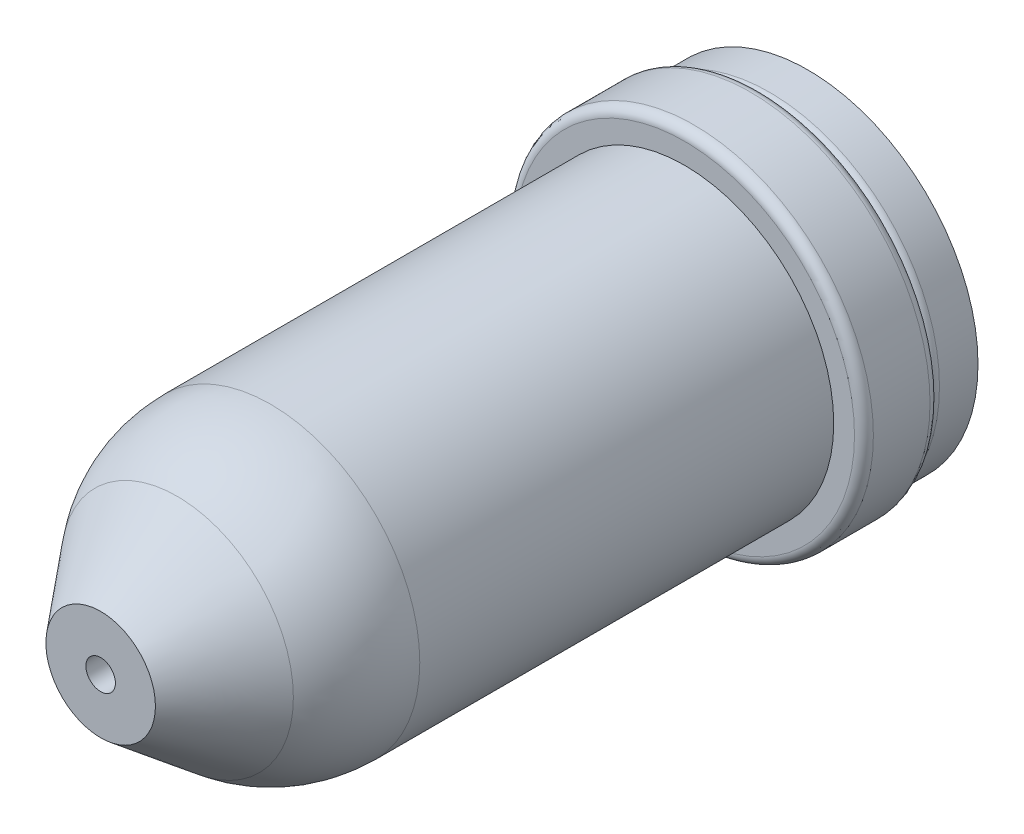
ISO-10303-21;
HEADER;
FILE_DESCRIPTION(('STEP AP214'),'2;1');
FILE_NAME('part.step','',(''),(''),'','','');
FILE_SCHEMA(('AUTOMOTIVE_DESIGN { 1 0 10303 214 1 1 1 1 }'));
ENDSEC;
DATA;
#1=APPLICATION_CONTEXT('core data for automotive mechanical design processes');
#2=APPLICATION_PROTOCOL_DEFINITION('international standard','automotive_design',2000,#1);
#3=PRODUCT_CONTEXT('',#1,'mechanical');
#4=PRODUCT('Part','Part','',(#3));
#5=PRODUCT_RELATED_PRODUCT_CATEGORY('part','',(#4));
#6=PRODUCT_DEFINITION_FORMATION('','',#4);
#7=PRODUCT_DEFINITION_CONTEXT('part definition',#1,'design');
#8=PRODUCT_DEFINITION('design','',#6,#7);
#9=PRODUCT_DEFINITION_SHAPE('','',#8);
#10=(LENGTH_UNIT() NAMED_UNIT(*) SI_UNIT(.MILLI.,.METRE.));
#11=(NAMED_UNIT(*) PLANE_ANGLE_UNIT() SI_UNIT($,.RADIAN.));
#12=(NAMED_UNIT(*) SI_UNIT($,.STERADIAN.) SOLID_ANGLE_UNIT());
#13=UNCERTAINTY_MEASURE_WITH_UNIT(LENGTH_MEASURE(1.E-05),#10,'distance_accuracy_value','');
#14=(GEOMETRIC_REPRESENTATION_CONTEXT(3) GLOBAL_UNCERTAINTY_ASSIGNED_CONTEXT((#13)) GLOBAL_UNIT_ASSIGNED_CONTEXT((#10,
#11,#12)) REPRESENTATION_CONTEXT('',''));
#15=CARTESIAN_POINT('',(0.,0.,0.));
#16=DIRECTION('',(0.,0.,1.));
#17=DIRECTION('',(1.,0.,0.));
#18=AXIS2_PLACEMENT_3D('',#15,#16,#17);
#19=CARTESIAN_POINT('',(21.7814439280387,-2.02947748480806,-237.871));
#20=DIRECTION('',(0.,0.,1.));
#21=DIRECTION('',(1.,0.,0.));
#22=AXIS2_PLACEMENT_3D('',#19,#20,#21);
#23=PLANE('',#22);
#24=CARTESIAN_POINT('',(-29.2648084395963,16.8960450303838,-237.871));
#25=DIRECTION('',(0.,0.,-1.));
#26=DIRECTION('',(-1.,0.,0.));
#27=AXIS2_PLACEMENT_3D('',#24,#25,#26);
#28=CIRCLE('',#27,2.5527);
#29=CARTESIAN_POINT('',(-31.8175084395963,16.8960450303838,-237.871));
#30=VERTEX_POINT('',#29);
#31=EDGE_CURVE('E121',#30,#30,#28,.T.);
#32=ORIENTED_EDGE('',*,*,#31,.F.);
#33=EDGE_LOOP('',(#32));
#34=FACE_BOUND('',#33,.T.);
#35=CARTESIAN_POINT('',(0.,-33.7920900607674,-237.871));
#36=DIRECTION('',(0.,0.,-1.));
#37=DIRECTION('',(-1.,0.,0.));
#38=AXIS2_PLACEMENT_3D('',#35,#36,#37);
#39=CIRCLE('',#38,2.5527);
#40=CARTESIAN_POINT('',(-2.55270000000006,-33.7920900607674,-237.871));
#41=VERTEX_POINT('',#40);
#42=EDGE_CURVE('E138',#41,#41,#39,.T.);
#43=ORIENTED_EDGE('',*,*,#42,.F.);
#44=EDGE_LOOP('',(#43));
#45=FACE_BOUND('',#44,.T.);
#46=CARTESIAN_POINT('',(29.2648084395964,16.8960450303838,-237.871));
#47=DIRECTION('',(0.,0.,-1.));
#48=DIRECTION('',(-1.,0.,0.));
#49=AXIS2_PLACEMENT_3D('',#46,#47,#48);
#50=CIRCLE('',#49,2.5527);
#51=CARTESIAN_POINT('',(26.7121084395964,16.8960450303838,-237.871));
#52=VERTEX_POINT('',#51);
#53=EDGE_CURVE('E122',#52,#52,#50,.T.);
#54=ORIENTED_EDGE('',*,*,#53,.F.);
#55=EDGE_LOOP('',(#54));
#56=FACE_BOUND('',#55,.T.);
#57=CARTESIAN_POINT('',(0.,0.,-237.871));
#58=DIRECTION('',(0.,0.,-1.));
#59=DIRECTION('',(-1.,0.,0.));
#60=AXIS2_PLACEMENT_3D('',#57,#58,#59);
#61=CIRCLE('',#60,57.15);
#62=CARTESIAN_POINT('',(-57.15,0.,-237.871));
#63=VERTEX_POINT('',#62);
#64=EDGE_CURVE('E131',#63,#63,#61,.T.);
#65=ORIENTED_EDGE('',*,*,#64,.T.);
#66=EDGE_LOOP('',(#65));
#67=FACE_BOUND('',#66,.T.);
#68=CARTESIAN_POINT('',(25.2966020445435,-14.605,-237.871));
#69=DIRECTION('',(0.,0.,1.));
#70=DIRECTION('',(1.,0.,0.));
#71=AXIS2_PLACEMENT_3D('',#68,#69,#70);
#72=CIRCLE('',#71,22.225);
#73=CARTESIAN_POINT('',(47.5216020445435,-14.605,-237.871));
#74=VERTEX_POINT('',#73);
#75=EDGE_CURVE('E194',#74,#74,#72,.F.);
#76=ORIENTED_EDGE('',*,*,#75,.F.);
#77=EDGE_LOOP('',(#76));
#78=FACE_BOUND('',#77,.T.);
#79=CARTESIAN_POINT('',(-25.2966020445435,-14.6049999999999,-237.871));
#80=DIRECTION('',(0.,0.,1.));
#81=DIRECTION('',(1.,0.,0.));
#82=AXIS2_PLACEMENT_3D('',#79,#80,#81);
#83=CIRCLE('',#82,22.225);
#84=CARTESIAN_POINT('',(-3.07160204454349,-14.6049999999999,-237.871));
#85=VERTEX_POINT('',#84);
#86=EDGE_CURVE('E198',#85,#85,#83,.F.);
#87=ORIENTED_EDGE('',*,*,#86,.F.);
#88=EDGE_LOOP('',(#87));
#89=FACE_BOUND('',#88,.T.);
#90=CARTESIAN_POINT('',(1.04083408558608E-13,29.2100000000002,-237.871));
#91=DIRECTION('',(0.,0.,1.));
#92=DIRECTION('',(1.,0.,0.));
#93=AXIS2_PLACEMENT_3D('',#90,#91,#92);
#94=CIRCLE('',#93,22.225);
#95=CARTESIAN_POINT('',(22.2250000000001,29.2100000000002,-237.871));
#96=VERTEX_POINT('',#95);
#97=EDGE_CURVE('E202',#96,#96,#94,.F.);
#98=ORIENTED_EDGE('',*,*,#97,.F.);
#99=EDGE_LOOP('',(#98));
#100=FACE_BOUND('',#99,.T.);
#101=ADVANCED_FACE('F84',(#34,#45,#56,#67,#78,#89,#100),#23,.F.);
#102=CARTESIAN_POINT('',(0.,0.,0.));
#103=DIRECTION('',(0.,0.,1.));
#104=DIRECTION('',(1.,0.,0.));
#105=AXIS2_PLACEMENT_3D('',#102,#103,#104);
#106=CYLINDRICAL_SURFACE('',#105,57.15);
#107=ORIENTED_EDGE('',*,*,#64,.F.);
#108=EDGE_LOOP('',(#107));
#109=FACE_BOUND('',#108,.T.);
#110=CARTESIAN_POINT('',(0.,0.,-224.917));
#111=DIRECTION('',(0.,0.,1.));
#112=DIRECTION('',(1.,0.,0.));
#113=AXIS2_PLACEMENT_3D('',#110,#111,#112);
#114=CIRCLE('',#113,57.15);
#115=CARTESIAN_POINT('',(57.15,0.,-224.917));
#116=VERTEX_POINT('',#115);
#117=EDGE_CURVE('E186',#116,#116,#114,.T.);
#118=ORIENTED_EDGE('',*,*,#117,.F.);
#119=EDGE_LOOP('',(#118));
#120=FACE_BOUND('',#119,.T.);
#121=ADVANCED_FACE('F236',(#109,#120),#106,.T.);
#122=CARTESIAN_POINT('',(0.,0.,-224.917));
#123=DIRECTION('',(0.,0.,1.));
#124=DIRECTION('',(1.,0.,0.));
#125=AXIS2_PLACEMENT_3D('',#122,#123,#124);
#126=TOROIDAL_SURFACE('',#125,53.975,3.175);
#127=ORIENTED_EDGE('',*,*,#117,.T.);
#128=EDGE_LOOP('',(#127));
#129=FACE_BOUND('',#128,.T.);
#130=CARTESIAN_POINT('',(0.,0.,-221.742));
#131=DIRECTION('',(0.,0.,1.));
#132=DIRECTION('',(1.,0.,0.));
#133=AXIS2_PLACEMENT_3D('',#130,#131,#132);
#134=CIRCLE('',#133,53.975);
#135=CARTESIAN_POINT('',(53.975,0.,-221.742));
#136=VERTEX_POINT('',#135);
#137=EDGE_CURVE('E182',#136,#136,#134,.T.);
#138=ORIENTED_EDGE('',*,*,#137,.F.);
#139=EDGE_LOOP('',(#138));
#140=FACE_BOUND('',#139,.T.);
#141=ADVANCED_FACE('F242',(#129,#140),#126,.T.);
#142=CARTESIAN_POINT('',(57.15,0.,-221.742));
#143=DIRECTION('',(0.,0.,-1.));
#144=DIRECTION('',(-1.,0.,0.));
#145=AXIS2_PLACEMENT_3D('',#142,#143,#144);
#146=PLANE('',#145);
#147=CARTESIAN_POINT('',(0.,0.,-221.742));
#148=DIRECTION('',(0.,0.,1.));
#149=DIRECTION('',(1.,0.,0.));
#150=AXIS2_PLACEMENT_3D('',#147,#148,#149);
#151=CIRCLE('',#150,57.15);
#152=CARTESIAN_POINT('',(57.15,0.,-221.742));
#153=VERTEX_POINT('',#152);
#154=EDGE_CURVE('E154',#153,#153,#151,.T.);
#155=ORIENTED_EDGE('',*,*,#154,.F.);
#156=EDGE_LOOP('',(#155));
#157=FACE_BOUND('',#156,.T.);
#158=ORIENTED_EDGE('',*,*,#137,.T.);
#159=EDGE_LOOP('',(#158));
#160=FACE_BOUND('',#159,.T.);
#161=ADVANCED_FACE('F251',(#157,#160),#146,.T.);
#162=CARTESIAN_POINT('',(50.165,0.,-196.342));
#163=DIRECTION('',(0.,0.,1.));
#164=DIRECTION('',(1.,0.,0.));
#165=AXIS2_PLACEMENT_3D('',#162,#163,#164);
#166=PLANE('',#165);
#167=CARTESIAN_POINT('',(0.,0.,-196.342));
#168=DIRECTION('',(0.,0.,1.));
#169=DIRECTION('',(1.,0.,0.));
#170=AXIS2_PLACEMENT_3D('',#167,#168,#169);
#171=CIRCLE('',#170,57.15);
#172=CARTESIAN_POINT('',(57.15,0.,-196.342));
#173=VERTEX_POINT('',#172);
#174=EDGE_CURVE('E166',#173,#173,#171,.T.);
#175=ORIENTED_EDGE('',*,*,#174,.T.);
#176=EDGE_LOOP('',(#175));
#177=FACE_BOUND('',#176,.T.);
#178=CARTESIAN_POINT('',(0.,0.,-196.342));
#179=DIRECTION('',(0.,0.,1.));
#180=DIRECTION('',(1.,0.,0.));
#181=AXIS2_PLACEMENT_3D('',#178,#179,#180);
#182=CIRCLE('',#181,50.165);
#183=CARTESIAN_POINT('',(50.165,0.,-196.342));
#184=VERTEX_POINT('',#183);
#185=EDGE_CURVE('E190',#184,#184,#182,.F.);
#186=ORIENTED_EDGE('',*,*,#185,.T.);
#187=EDGE_LOOP('',(#186));
#188=FACE_BOUND('',#187,.T.);
#189=ADVANCED_FACE('F254',(#177,#188),#166,.T.);
#190=CARTESIAN_POINT('',(0.,0.,-199.517));
#191=DIRECTION('',(0.,0.,1.));
#192=DIRECTION('',(1.,0.,0.));
#193=AXIS2_PLACEMENT_3D('',#190,#191,#192);
#194=TOROIDAL_SURFACE('',#193,57.15,3.175);
#195=CARTESIAN_POINT('',(0.,0.,-199.517));
#196=DIRECTION('',(0.,0.,1.));
#197=DIRECTION('',(1.,0.,0.));
#198=AXIS2_PLACEMENT_3D('',#195,#196,#197);
#199=CIRCLE('',#198,60.325);
#200=CARTESIAN_POINT('',(60.325,0.,-199.517));
#201=VERTEX_POINT('',#200);
#202=EDGE_CURVE('E162',#201,#201,#199,.T.);
#203=ORIENTED_EDGE('',*,*,#202,.T.);
#204=EDGE_LOOP('',(#203));
#205=FACE_BOUND('',#204,.T.);
#206=ORIENTED_EDGE('',*,*,#174,.F.);
#207=EDGE_LOOP('',(#206));
#208=FACE_BOUND('',#207,.T.);
#209=ADVANCED_FACE('F264',(#205,#208),#194,.T.);
#210=CARTESIAN_POINT('',(0.,0.,0.));
#211=DIRECTION('',(0.,0.,1.));
#212=DIRECTION('',(1.,0.,0.));
#213=AXIS2_PLACEMENT_3D('',#210,#211,#212);
#214=CYLINDRICAL_SURFACE('',#213,60.325);
#215=CARTESIAN_POINT('',(0.,0.,-218.567));
#216=DIRECTION('',(0.,0.,1.));
#217=DIRECTION('',(1.,0.,0.));
#218=AXIS2_PLACEMENT_3D('',#215,#216,#217);
#219=CIRCLE('',#218,60.325);
#220=CARTESIAN_POINT('',(60.325,0.,-218.567));
#221=VERTEX_POINT('',#220);
#222=EDGE_CURVE('E158',#221,#221,#219,.T.);
#223=ORIENTED_EDGE('',*,*,#222,.T.);
#224=EDGE_LOOP('',(#223));
#225=FACE_BOUND('',#224,.T.);
#226=ORIENTED_EDGE('',*,*,#202,.F.);
#227=EDGE_LOOP('',(#226));
#228=FACE_BOUND('',#227,.T.);
#229=ADVANCED_FACE('F260',(#225,#228),#214,.T.);
#230=CARTESIAN_POINT('',(0.,0.,-218.567));
#231=DIRECTION('',(0.,0.,1.));
#232=DIRECTION('',(1.,0.,0.));
#233=AXIS2_PLACEMENT_3D('',#230,#231,#232);
#234=TOROIDAL_SURFACE('',#233,57.15,3.175);
#235=ORIENTED_EDGE('',*,*,#154,.T.);
#236=EDGE_LOOP('',(#235));
#237=FACE_BOUND('',#236,.T.);
#238=ORIENTED_EDGE('',*,*,#222,.F.);
#239=EDGE_LOOP('',(#238));
#240=FACE_BOUND('',#239,.T.);
#241=ADVANCED_FACE('F256',(#237,#240),#234,.T.);
#242=CARTESIAN_POINT('',(18.415,0.,0.));
#243=DIRECTION('',(0.,0.,1.));
#244=DIRECTION('',(1.,0.,0.));
#245=AXIS2_PLACEMENT_3D('',#242,#243,#244);
#246=PLANE('',#245);
#247=CARTESIAN_POINT('',(0.,0.,0.));
#248=DIRECTION('',(0.,0.,1.));
#249=DIRECTION('',(1.,0.,0.));
#250=AXIS2_PLACEMENT_3D('',#247,#248,#249);
#251=CIRCLE('',#250,4.96062);
#252=CARTESIAN_POINT('',(4.96062,0.,0.));
#253=VERTEX_POINT('',#252);
#254=EDGE_CURVE('E146',#253,#253,#251,.T.);
#255=ORIENTED_EDGE('',*,*,#254,.F.);
#256=EDGE_LOOP('',(#255));
#257=FACE_BOUND('',#256,.T.);
#258=CARTESIAN_POINT('',(0.,0.,0.));
#259=DIRECTION('',(0.,0.,1.));
#260=DIRECTION('',(1.,0.,0.));
#261=AXIS2_PLACEMENT_3D('',#258,#259,#260);
#262=CIRCLE('',#261,18.415);
#263=CARTESIAN_POINT('',(18.415,0.,0.));
#264=VERTEX_POINT('',#263);
#265=EDGE_CURVE('E170',#264,#264,#262,.T.);
#266=ORIENTED_EDGE('',*,*,#265,.T.);
#267=EDGE_LOOP('',(#266));
#268=FACE_BOUND('',#267,.T.);
#269=ADVANCED_FACE('F259',(#257,#268),#246,.T.);
#270=CARTESIAN_POINT('',(0.,0.,0.));
#271=DIRECTION('',(0.,0.,-1.));
#272=DIRECTION('',(-1.,0.,0.));
#273=AXIS2_PLACEMENT_3D('',#270,#271,#272);
#274=CONICAL_SURFACE('',#273,18.415,0.67728119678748);
#275=CARTESIAN_POINT('',(0.,0.,-25.7127665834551));
#276=DIRECTION('',(0.,0.,1.));
#277=DIRECTION('',(1.,0.,0.));
#278=AXIS2_PLACEMENT_3D('',#275,#276,#277);
#279=CIRCLE('',#278,39.0925514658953);
#280=CARTESIAN_POINT('',(39.0925514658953,0.,-25.7127665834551));
#281=VERTEX_POINT('',#280);
#282=EDGE_CURVE('E174',#281,#281,#279,.T.);
#283=ORIENTED_EDGE('',*,*,#282,.T.);
#284=EDGE_LOOP('',(#283));
#285=FACE_BOUND('',#284,.T.);
#286=ORIENTED_EDGE('',*,*,#265,.F.);
#287=EDGE_LOOP('',(#286));
#288=FACE_BOUND('',#287,.T.);
#289=ADVANCED_FACE('F272',(#285,#288),#274,.T.);
#290=CARTESIAN_POINT('',(0.,0.,-57.15));
#291=DIRECTION('',(0.,0.,1.));
#292=DIRECTION('',(1.,0.,0.));
#293=AXIS2_PLACEMENT_3D('',#290,#291,#292);
#294=SPHERICAL_SURFACE('',#293,50.165);
#295=CARTESIAN_POINT('',(0.,0.,-57.15));
#296=DIRECTION('',(0.,0.,1.));
#297=DIRECTION('',(1.,0.,0.));
#298=AXIS2_PLACEMENT_3D('',#295,#296,#297);
#299=CIRCLE('',#298,50.165);
#300=CARTESIAN_POINT('',(50.165,0.,-57.15));
#301=VERTEX_POINT('',#300);
#302=EDGE_CURVE('E178',#301,#301,#299,.T.);
#303=ORIENTED_EDGE('',*,*,#302,.T.);
#304=EDGE_LOOP('',(#303));
#305=FACE_BOUND('',#304,.T.);
#306=ORIENTED_EDGE('',*,*,#282,.F.);
#307=EDGE_LOOP('',(#306));
#308=FACE_BOUND('',#307,.T.);
#309=ADVANCED_FACE('F275',(#305,#308),#294,.T.);
#310=CARTESIAN_POINT('',(0.,0.,0.));
#311=DIRECTION('',(0.,0.,1.));
#312=DIRECTION('',(1.,0.,0.));
#313=AXIS2_PLACEMENT_3D('',#310,#311,#312);
#314=CYLINDRICAL_SURFACE('',#313,50.165);
#315=ORIENTED_EDGE('',*,*,#185,.F.);
#316=EDGE_LOOP('',(#315));
#317=FACE_BOUND('',#316,.T.);
#318=ORIENTED_EDGE('',*,*,#302,.F.);
#319=EDGE_LOOP('',(#318));
#320=FACE_BOUND('',#319,.T.);
#321=ADVANCED_FACE('F279',(#317,#320),#314,.T.);
#322=CARTESIAN_POINT('',(0.,0.,-28.575));
#323=DIRECTION('',(0.,0.,1.));
#324=DIRECTION('',(1.,0.,0.));
#325=AXIS2_PLACEMENT_3D('',#322,#323,#324);
#326=CONICAL_SURFACE('',#325,4.96061999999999,1.02974425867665);
#327=CARTESIAN_POINT('',(0.,0.,-31.5556412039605));
#328=VERTEX_POINT('',#327);
#329=VERTEX_LOOP('',#328);
#330=FACE_BOUND('',#329,.T.);
#331=CARTESIAN_POINT('',(0.,0.,-28.575));
#332=DIRECTION('',(0.,0.,1.));
#333=DIRECTION('',(1.,0.,0.));
#334=AXIS2_PLACEMENT_3D('',#331,#332,#333);
#335=CIRCLE('',#334,4.96061999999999);
#336=CARTESIAN_POINT('',(4.96061999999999,0.,-28.575));
#337=VERTEX_POINT('',#336);
#338=EDGE_CURVE('E150',#337,#337,#335,.T.);
#339=ORIENTED_EDGE('',*,*,#338,.T.);
#340=EDGE_LOOP('',(#339));
#341=FACE_BOUND('',#340,.T.);
#342=ADVANCED_FACE('F249',(#330,#341),#326,.F.);
#343=CARTESIAN_POINT('',(0.,0.,0.));
#344=DIRECTION('',(0.,0.,1.));
#345=DIRECTION('',(1.,0.,0.));
#346=AXIS2_PLACEMENT_3D('',#343,#344,#345);
#347=CYLINDRICAL_SURFACE('',#346,4.96062);
#348=ORIENTED_EDGE('',*,*,#338,.F.);
#349=EDGE_LOOP('',(#348));
#350=FACE_BOUND('',#349,.T.);
#351=ORIENTED_EDGE('',*,*,#254,.T.);
#352=EDGE_LOOP('',(#351));
#353=FACE_BOUND('',#352,.T.);
#354=ADVANCED_FACE('F114',(#350,#353),#347,.F.);
#355=CARTESIAN_POINT('',(29.2648084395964,16.8960450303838,-218.821));
#356=DIRECTION('',(0.,0.,-1.));
#357=DIRECTION('',(-1.,0.,0.));
#358=AXIS2_PLACEMENT_3D('',#355,#356,#357);
#359=CONICAL_SURFACE('',#358,2.5527,1.02974425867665);
#360=CARTESIAN_POINT('',(29.2648084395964,16.8960450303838,-217.287183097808));
#361=VERTEX_POINT('',#360);
#362=VERTEX_LOOP('',#361);
#363=FACE_BOUND('',#362,.T.);
#364=CARTESIAN_POINT('',(29.2648084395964,16.8960450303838,-218.821));
#365=DIRECTION('',(0.,0.,-1.));
#366=DIRECTION('',(-1.,0.,0.));
#367=AXIS2_PLACEMENT_3D('',#364,#365,#366);
#368=CIRCLE('',#367,2.5527);
#369=CARTESIAN_POINT('',(26.7121084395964,16.8960450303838,-218.821));
#370=VERTEX_POINT('',#369);
#371=EDGE_CURVE('E118',#370,#370,#368,.T.);
#372=ORIENTED_EDGE('',*,*,#371,.T.);
#373=EDGE_LOOP('',(#372));
#374=FACE_BOUND('',#373,.T.);
#375=ADVANCED_FACE('F110',(#363,#374),#359,.F.);
#376=CARTESIAN_POINT('',(0.,-33.7920900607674,-218.821));
#377=DIRECTION('',(0.,0.,-1.));
#378=DIRECTION('',(-1.,0.,0.));
#379=AXIS2_PLACEMENT_3D('',#376,#377,#378);
#380=CONICAL_SURFACE('',#379,2.5527,1.02974425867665);
#381=CARTESIAN_POINT('',(0.,-33.7920900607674,-217.287183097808));
#382=VERTEX_POINT('',#381);
#383=VERTEX_LOOP('',#382);
#384=FACE_BOUND('',#383,.T.);
#385=CARTESIAN_POINT('',(0.,-33.7920900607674,-218.821));
#386=DIRECTION('',(0.,0.,-1.));
#387=DIRECTION('',(-1.,0.,0.));
#388=AXIS2_PLACEMENT_3D('',#385,#386,#387);
#389=CIRCLE('',#388,2.5527);
#390=CARTESIAN_POINT('',(-2.55270000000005,-33.7920900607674,-218.821));
#391=VERTEX_POINT('',#390);
#392=EDGE_CURVE('E142',#391,#391,#389,.T.);
#393=ORIENTED_EDGE('',*,*,#392,.T.);
#394=EDGE_LOOP('',(#393));
#395=FACE_BOUND('',#394,.T.);
#396=ADVANCED_FACE('F113',(#384,#395),#380,.F.);
#397=CARTESIAN_POINT('',(-29.2648084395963,16.8960450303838,-218.821));
#398=DIRECTION('',(0.,0.,-1.));
#399=DIRECTION('',(-1.,0.,0.));
#400=AXIS2_PLACEMENT_3D('',#397,#398,#399);
#401=CONICAL_SURFACE('',#400,2.5527,1.02974425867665);
#402=CARTESIAN_POINT('',(-29.2648084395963,16.8960450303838,-217.287183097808));
#403=VERTEX_POINT('',#402);
#404=VERTEX_LOOP('',#403);
#405=FACE_BOUND('',#404,.T.);
#406=CARTESIAN_POINT('',(-29.2648084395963,16.8960450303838,-218.821));
#407=DIRECTION('',(0.,0.,-1.));
#408=DIRECTION('',(-1.,0.,0.));
#409=AXIS2_PLACEMENT_3D('',#406,#407,#408);
#410=CIRCLE('',#409,2.5527);
#411=CARTESIAN_POINT('',(-31.8175084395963,16.8960450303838,-218.821));
#412=VERTEX_POINT('',#411);
#413=EDGE_CURVE('E128',#412,#412,#410,.T.);
#414=ORIENTED_EDGE('',*,*,#413,.T.);
#415=EDGE_LOOP('',(#414));
#416=FACE_BOUND('',#415,.T.);
#417=ADVANCED_FACE('F329',(#405,#416),#401,.F.);
#418=CARTESIAN_POINT('',(29.2648084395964,16.8960450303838,-237.871));
#419=DIRECTION('',(0.,0.,-1.));
#420=DIRECTION('',(-1.,0.,0.));
#421=AXIS2_PLACEMENT_3D('',#418,#419,#420);
#422=CYLINDRICAL_SURFACE('',#421,2.5527);
#423=ORIENTED_EDGE('',*,*,#371,.F.);
#424=EDGE_LOOP('',(#423));
#425=FACE_BOUND('',#424,.T.);
#426=ORIENTED_EDGE('',*,*,#53,.T.);
#427=EDGE_LOOP('',(#426));
#428=FACE_BOUND('',#427,.T.);
#429=ADVANCED_FACE('F326',(#425,#428),#422,.F.);
#430=CARTESIAN_POINT('',(0.,-33.7920900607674,-237.871));
#431=DIRECTION('',(0.,0.,-1.));
#432=DIRECTION('',(-1.,0.,0.));
#433=AXIS2_PLACEMENT_3D('',#430,#431,#432);
#434=CYLINDRICAL_SURFACE('',#433,2.5527);
#435=ORIENTED_EDGE('',*,*,#392,.F.);
#436=EDGE_LOOP('',(#435));
#437=FACE_BOUND('',#436,.T.);
#438=ORIENTED_EDGE('',*,*,#42,.T.);
#439=EDGE_LOOP('',(#438));
#440=FACE_BOUND('',#439,.T.);
#441=ADVANCED_FACE('F328',(#437,#440),#434,.F.);
#442=CARTESIAN_POINT('',(-29.2648084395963,16.8960450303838,-237.871));
#443=DIRECTION('',(0.,0.,-1.));
#444=DIRECTION('',(-1.,0.,0.));
#445=AXIS2_PLACEMENT_3D('',#442,#443,#444);
#446=CYLINDRICAL_SURFACE('',#445,2.5527);
#447=ORIENTED_EDGE('',*,*,#413,.F.);
#448=EDGE_LOOP('',(#447));
#449=FACE_BOUND('',#448,.T.);
#450=ORIENTED_EDGE('',*,*,#31,.T.);
#451=EDGE_LOOP('',(#450));
#452=FACE_BOUND('',#451,.T.);
#453=ADVANCED_FACE('F324',(#449,#452),#446,.F.);
#454=CARTESIAN_POINT('',(25.2966020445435,-14.605,-241.046));
#455=DIRECTION('',(0.,0.,1.));
#456=DIRECTION('',(1.,0.,0.));
#457=AXIS2_PLACEMENT_3D('',#454,#455,#456);
#458=CYLINDRICAL_SURFACE('',#457,22.225);
#459=CARTESIAN_POINT('',(25.2966020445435,-14.605,-240.411));
#460=DIRECTION('',(0.,0.,-1.));
#461=DIRECTION('',(-1.,0.,0.));
#462=AXIS2_PLACEMENT_3D('',#459,#460,#461);
#463=CIRCLE('',#462,22.225);
#464=CARTESIAN_POINT('',(3.07160204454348,-14.605,-240.411));
#465=VERTEX_POINT('',#464);
#466=EDGE_CURVE('E12',#465,#465,#463,.F.);
#467=ORIENTED_EDGE('',*,*,#466,.T.);
#468=EDGE_LOOP('',(#467));
#469=FACE_BOUND('',#468,.T.);
#470=ORIENTED_EDGE('',*,*,#75,.T.);
#471=EDGE_LOOP('',(#470));
#472=FACE_BOUND('',#471,.T.);
#473=ADVANCED_FACE('F321',(#469,#472),#458,.T.);
#474=CARTESIAN_POINT('',(25.2966020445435,-14.605,-241.046));
#475=DIRECTION('',(0.,0.,-1.));
#476=DIRECTION('',(-1.,0.,0.));
#477=AXIS2_PLACEMENT_3D('',#474,#475,#476);
#478=PLANE('',#477);
#479=CARTESIAN_POINT('',(25.2966020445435,-14.605,-241.046));
#480=DIRECTION('',(0.,0.,-1.));
#481=DIRECTION('',(-1.,0.,0.));
#482=AXIS2_PLACEMENT_3D('',#479,#480,#481);
#483=CIRCLE('',#482,21.59);
#484=CARTESIAN_POINT('',(3.70660204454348,-14.605,-241.046));
#485=VERTEX_POINT('',#484);
#486=EDGE_CURVE('E93',#485,#485,#483,.T.);
#487=ORIENTED_EDGE('',*,*,#486,.T.);
#488=EDGE_LOOP('',(#487));
#489=FACE_BOUND('',#488,.T.);
#490=ADVANCED_FACE('F224',(#489),#478,.T.);
#491=CARTESIAN_POINT('',(-25.2966020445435,-14.6049999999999,-241.046));
#492=DIRECTION('',(0.,0.,1.));
#493=DIRECTION('',(1.,0.,0.));
#494=AXIS2_PLACEMENT_3D('',#491,#492,#493);
#495=CYLINDRICAL_SURFACE('',#494,22.225);
#496=CARTESIAN_POINT('',(-25.2966020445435,-14.6049999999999,-240.411));
#497=DIRECTION('',(0.,0.,-1.));
#498=DIRECTION('',(-1.,0.,0.));
#499=AXIS2_PLACEMENT_3D('',#496,#497,#498);
#500=CIRCLE('',#499,22.225);
#501=CARTESIAN_POINT('',(-47.5216020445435,-14.6049999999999,-240.411));
#502=VERTEX_POINT('',#501);
#503=EDGE_CURVE('E218',#502,#502,#500,.F.);
#504=ORIENTED_EDGE('',*,*,#503,.T.);
#505=EDGE_LOOP('',(#504));
#506=FACE_BOUND('',#505,.T.);
#507=ORIENTED_EDGE('',*,*,#86,.T.);
#508=EDGE_LOOP('',(#507));
#509=FACE_BOUND('',#508,.T.);
#510=ADVANCED_FACE('F312',(#506,#509),#495,.T.);
#511=CARTESIAN_POINT('',(-25.2966020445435,-14.6049999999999,-241.046));
#512=DIRECTION('',(0.,0.,-1.));
#513=DIRECTION('',(-1.,0.,0.));
#514=AXIS2_PLACEMENT_3D('',#511,#512,#513);
#515=PLANE('',#514);
#516=CARTESIAN_POINT('',(-25.2966020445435,-14.6049999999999,-241.046));
#517=DIRECTION('',(0.,0.,-1.));
#518=DIRECTION('',(-1.,0.,0.));
#519=AXIS2_PLACEMENT_3D('',#516,#517,#518);
#520=CIRCLE('',#519,21.59);
#521=CARTESIAN_POINT('',(-46.8866020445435,-14.6049999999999,-241.046));
#522=VERTEX_POINT('',#521);
#523=EDGE_CURVE('E214',#522,#522,#520,.T.);
#524=ORIENTED_EDGE('',*,*,#523,.T.);
#525=EDGE_LOOP('',(#524));
#526=FACE_BOUND('',#525,.T.);
#527=ADVANCED_FACE('F305',(#526),#515,.T.);
#528=CARTESIAN_POINT('',(1.04083408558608E-13,29.2100000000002,-241.046));
#529=DIRECTION('',(0.,0.,1.));
#530=DIRECTION('',(1.,0.,0.));
#531=AXIS2_PLACEMENT_3D('',#528,#529,#530);
#532=CYLINDRICAL_SURFACE('',#531,22.225);
#533=CARTESIAN_POINT('',(1.04083408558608E-13,29.2100000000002,-240.411));
#534=DIRECTION('',(0.,0.,-1.));
#535=DIRECTION('',(-1.,0.,0.));
#536=AXIS2_PLACEMENT_3D('',#533,#534,#535);
#537=CIRCLE('',#536,22.225);
#538=CARTESIAN_POINT('',(-22.2249999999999,29.2100000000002,-240.411));
#539=VERTEX_POINT('',#538);
#540=EDGE_CURVE('E210',#539,#539,#537,.F.);
#541=ORIENTED_EDGE('',*,*,#540,.T.);
#542=EDGE_LOOP('',(#541));
#543=FACE_BOUND('',#542,.T.);
#544=ORIENTED_EDGE('',*,*,#97,.T.);
#545=EDGE_LOOP('',(#544));
#546=FACE_BOUND('',#545,.T.);
#547=ADVANCED_FACE('F296',(#543,#546),#532,.T.);
#548=CARTESIAN_POINT('',(1.04083408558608E-13,29.2100000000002,-241.046));
#549=DIRECTION('',(0.,0.,-1.));
#550=DIRECTION('',(-1.,0.,0.));
#551=AXIS2_PLACEMENT_3D('',#548,#549,#550);
#552=PLANE('',#551);
#553=CARTESIAN_POINT('',(1.04083408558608E-13,29.2100000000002,-241.046));
#554=DIRECTION('',(0.,0.,-1.));
#555=DIRECTION('',(-1.,0.,0.));
#556=AXIS2_PLACEMENT_3D('',#553,#554,#555);
#557=CIRCLE('',#556,21.59);
#558=CARTESIAN_POINT('',(-21.5899999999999,29.2100000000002,-241.046));
#559=VERTEX_POINT('',#558);
#560=EDGE_CURVE('E206',#559,#559,#557,.T.);
#561=ORIENTED_EDGE('',*,*,#560,.T.);
#562=EDGE_LOOP('',(#561));
#563=FACE_BOUND('',#562,.T.);
#564=ADVANCED_FACE('F291',(#563),#552,.T.);
#565=CARTESIAN_POINT('',(1.04083408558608E-13,29.2100000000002,-240.411));
#566=DIRECTION('',(0.,0.,-1.));
#567=DIRECTION('',(-1.,0.,0.));
#568=AXIS2_PLACEMENT_3D('',#565,#566,#567);
#569=TOROIDAL_SURFACE('',#568,21.59,0.635);
#570=ORIENTED_EDGE('',*,*,#540,.F.);
#571=EDGE_LOOP('',(#570));
#572=FACE_BOUND('',#571,.T.);
#573=ORIENTED_EDGE('',*,*,#560,.F.);
#574=EDGE_LOOP('',(#573));
#575=FACE_BOUND('',#574,.T.);
#576=ADVANCED_FACE('F232',(#572,#575),#569,.T.);
#577=CARTESIAN_POINT('',(-25.2966020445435,-14.6049999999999,-240.411));
#578=DIRECTION('',(0.,0.,-1.));
#579=DIRECTION('',(-1.,0.,0.));
#580=AXIS2_PLACEMENT_3D('',#577,#578,#579);
#581=TOROIDAL_SURFACE('',#580,21.59,0.635);
#582=ORIENTED_EDGE('',*,*,#503,.F.);
#583=EDGE_LOOP('',(#582));
#584=FACE_BOUND('',#583,.T.);
#585=ORIENTED_EDGE('',*,*,#523,.F.);
#586=EDGE_LOOP('',(#585));
#587=FACE_BOUND('',#586,.T.);
#588=ADVANCED_FACE('F227',(#584,#587),#581,.T.);
#589=CARTESIAN_POINT('',(25.2966020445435,-14.605,-240.411));
#590=DIRECTION('',(0.,0.,-1.));
#591=DIRECTION('',(-1.,0.,0.));
#592=AXIS2_PLACEMENT_3D('',#589,#590,#591);
#593=TOROIDAL_SURFACE('',#592,21.59,0.635);
#594=ORIENTED_EDGE('',*,*,#466,.F.);
#595=EDGE_LOOP('',(#594));
#596=FACE_BOUND('',#595,.T.);
#597=ORIENTED_EDGE('',*,*,#486,.F.);
#598=EDGE_LOOP('',(#597));
#599=FACE_BOUND('',#598,.T.);
#600=ADVANCED_FACE('F86',(#596,#599),#593,.T.);
#601=CLOSED_SHELL('',(#101,#121,#141,#161,#189,#209,#229,#241,#269,#289,#309,#321,#342,#354,
#375,#396,#417,#429,#441,#453,#473,#490,#510,#527,#547,#564,#576,#588,#600));
#602=MANIFOLD_SOLID_BREP('B2',#601);
#603=ADVANCED_BREP_SHAPE_REPRESENTATION('',(#18,#602),#14);
#604=SHAPE_DEFINITION_REPRESENTATION(#9,#603);
ENDSEC;
END-ISO-10303-21;
